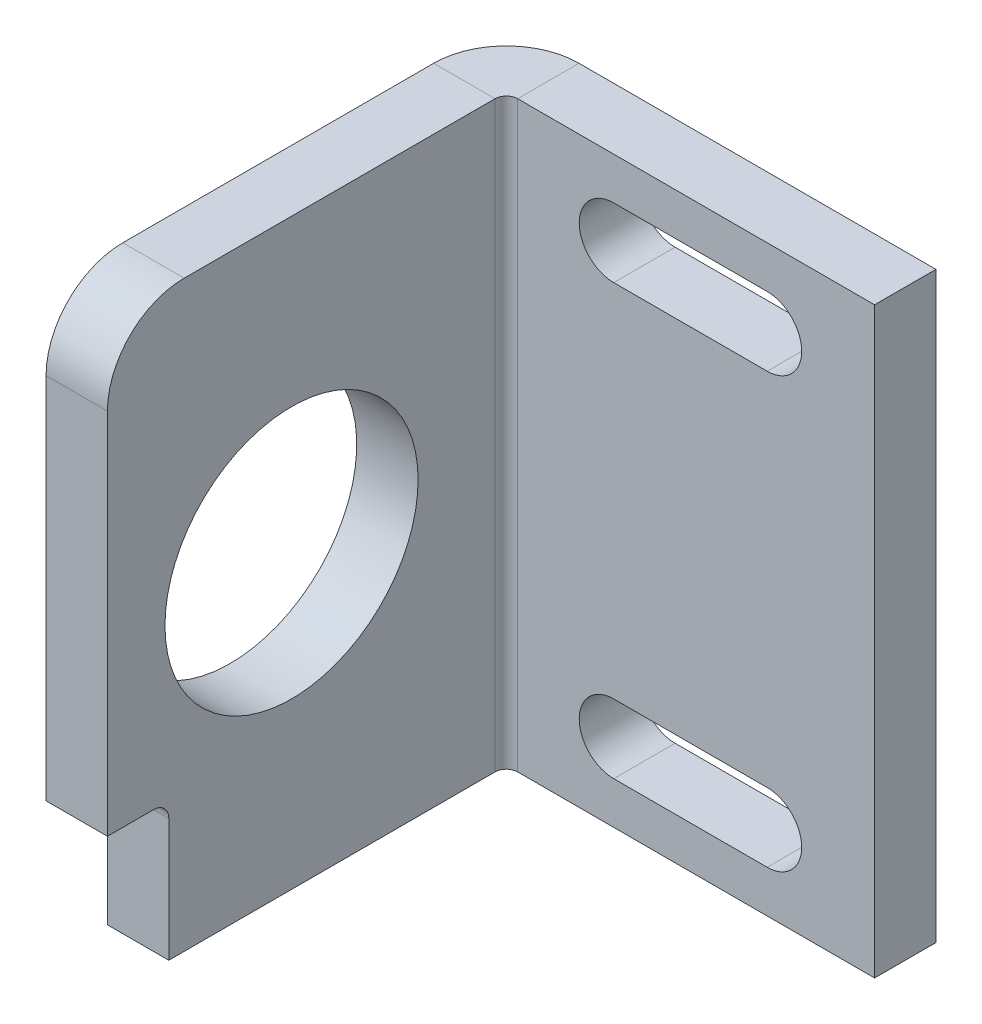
ISO-10303-21;
HEADER;
FILE_DESCRIPTION(('STEP AP214'),'2;1');
FILE_NAME('part.step','',(''),(''),'','','');
FILE_SCHEMA(('AUTOMOTIVE_DESIGN { 1 0 10303 214 1 1 1 1 }'));
ENDSEC;
DATA;
#1=APPLICATION_CONTEXT('core data for automotive mechanical design processes');
#2=APPLICATION_PROTOCOL_DEFINITION('international standard','automotive_design',2000,#1);
#3=PRODUCT_CONTEXT('',#1,'mechanical');
#4=PRODUCT('Part','Part','',(#3));
#5=PRODUCT_RELATED_PRODUCT_CATEGORY('part','',(#4));
#6=PRODUCT_DEFINITION_FORMATION('','',#4);
#7=PRODUCT_DEFINITION_CONTEXT('part definition',#1,'design');
#8=PRODUCT_DEFINITION('design','',#6,#7);
#9=PRODUCT_DEFINITION_SHAPE('','',#8);
#10=(LENGTH_UNIT() NAMED_UNIT(*) SI_UNIT(.MILLI.,.METRE.));
#11=(NAMED_UNIT(*) PLANE_ANGLE_UNIT() SI_UNIT($,.RADIAN.));
#12=(NAMED_UNIT(*) SI_UNIT($,.STERADIAN.) SOLID_ANGLE_UNIT());
#13=UNCERTAINTY_MEASURE_WITH_UNIT(LENGTH_MEASURE(1.E-05),#10,'distance_accuracy_value','');
#14=(GEOMETRIC_REPRESENTATION_CONTEXT(3) GLOBAL_UNCERTAINTY_ASSIGNED_CONTEXT((#13)) GLOBAL_UNIT_ASSIGNED_CONTEXT((#10,
#11,#12)) REPRESENTATION_CONTEXT('',''));
#15=CARTESIAN_POINT('',(0.,0.,0.));
#16=DIRECTION('',(0.,0.,1.));
#17=DIRECTION('',(1.,0.,0.));
#18=AXIS2_PLACEMENT_3D('',#15,#16,#17);
#19=CARTESIAN_POINT('',(-201.807760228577,20.970290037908,-4.));
#20=DIRECTION('',(0.,-1.,0.));
#21=DIRECTION('',(0.,0.,-1.));
#22=AXIS2_PLACEMENT_3D('',#19,#20,#21);
#23=PLANE('',#22);
#24=DIRECTION('',(1.,0.,0.));
#25=VECTOR('',#24,1.);
#26=CARTESIAN_POINT('',(-201.807760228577,20.970290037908,0.));
#27=LINE('',#26,#25);
#28=CARTESIAN_POINT('',(-197.071160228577,20.970290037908,0.));
#29=VERTEX_POINT('',#28);
#30=CARTESIAN_POINT('',(-173.807760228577,20.970290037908,0.));
#31=VERTEX_POINT('',#30);
#32=EDGE_CURVE('E219',#29,#31,#27,.T.);
#33=ORIENTED_EDGE('',*,*,#32,.F.);
#34=DIRECTION('',(0.,0.,-1.));
#35=VECTOR('',#34,1.);
#36=CARTESIAN_POINT('',(-197.071160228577,20.970290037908,0.));
#37=LINE('',#36,#35);
#38=CARTESIAN_POINT('',(-197.071160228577,20.970290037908,-4.));
#39=VERTEX_POINT('',#38);
#40=EDGE_CURVE('E208',#29,#39,#37,.T.);
#41=ORIENTED_EDGE('',*,*,#40,.T.);
#42=DIRECTION('',(1.,0.,0.));
#43=VECTOR('',#42,1.);
#44=CARTESIAN_POINT('',(-201.807760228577,20.970290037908,-4.));
#45=LINE('',#44,#43);
#46=CARTESIAN_POINT('',(-173.807760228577,20.970290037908,-4.));
#47=VERTEX_POINT('',#46);
#48=EDGE_CURVE('E222',#39,#47,#45,.T.);
#49=ORIENTED_EDGE('',*,*,#48,.T.);
#50=DIRECTION('',(0.,0.,1.));
#51=VECTOR('',#50,1.);
#52=CARTESIAN_POINT('',(-173.807760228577,20.970290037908,-4.));
#53=LINE('',#52,#51);
#54=EDGE_CURVE('E231',#47,#31,#53,.T.);
#55=ORIENTED_EDGE('',*,*,#54,.T.);
#56=EDGE_LOOP('',(#33,#41,#49,#55));
#57=FACE_BOUND('',#56,.T.);
#58=ADVANCED_FACE('F16',(#57),#23,.T.);
#59=CARTESIAN_POINT('',(0.,0.,-4.));
#60=DIRECTION('',(0.,0.,1.));
#61=DIRECTION('',(1.,0.,0.));
#62=AXIS2_PLACEMENT_3D('',#59,#60,#61);
#63=PLANE('',#62);
#64=DIRECTION('',(1.,0.,0.));
#65=VECTOR('',#64,1.);
#66=CARTESIAN_POINT('',(-180.807760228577,23.7202900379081,-4.));
#67=LINE('',#66,#65);
#68=CARTESIAN_POINT('',(-190.807760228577,23.7202900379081,-4.));
#69=VERTEX_POINT('',#68);
#70=CARTESIAN_POINT('',(-180.807760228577,23.7202900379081,-4.));
#71=VERTEX_POINT('',#70);
#72=EDGE_CURVE('E282',#69,#71,#67,.T.);
#73=ORIENTED_EDGE('',*,*,#72,.T.);
#74=CARTESIAN_POINT('',(-180.807760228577,25.970290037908,-4.));
#75=DIRECTION('',(0.,0.,1.));
#76=DIRECTION('',(-1.,0.,0.));
#77=AXIS2_PLACEMENT_3D('',#74,#75,#76);
#78=CIRCLE('',#77,2.24999999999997);
#79=CARTESIAN_POINT('',(-180.807760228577,28.220290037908,-4.));
#80=VERTEX_POINT('',#79);
#81=EDGE_CURVE('E272',#71,#80,#78,.T.);
#82=ORIENTED_EDGE('',*,*,#81,.T.);
#83=DIRECTION('',(-1.,0.,0.));
#84=VECTOR('',#83,1.);
#85=CARTESIAN_POINT('',(-180.807760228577,28.220290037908,-4.));
#86=LINE('',#85,#84);
#87=CARTESIAN_POINT('',(-190.807760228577,28.220290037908,-4.));
#88=VERTEX_POINT('',#87);
#89=EDGE_CURVE('E275',#80,#88,#86,.T.);
#90=ORIENTED_EDGE('',*,*,#89,.T.);
#91=CARTESIAN_POINT('',(-190.807760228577,25.970290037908,-4.));
#92=DIRECTION('',(0.,0.,1.));
#93=DIRECTION('',(-1.,0.,0.));
#94=AXIS2_PLACEMENT_3D('',#91,#92,#93);
#95=CIRCLE('',#94,2.24999999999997);
#96=EDGE_CURVE('E279',#88,#69,#95,.T.);
#97=ORIENTED_EDGE('',*,*,#96,.T.);
#98=EDGE_LOOP('',(#73,#82,#90,#97));
#99=FACE_BOUND('',#98,.T.);
#100=DIRECTION('',(1.,0.,0.));
#101=VECTOR('',#100,1.);
#102=CARTESIAN_POINT('',(-180.807760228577,51.7202900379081,-4.));
#103=LINE('',#102,#101);
#104=CARTESIAN_POINT('',(-190.807760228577,51.7202900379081,-4.));
#105=VERTEX_POINT('',#104);
#106=CARTESIAN_POINT('',(-180.807760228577,51.7202900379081,-4.));
#107=VERTEX_POINT('',#106);
#108=EDGE_CURVE('E314',#105,#107,#103,.T.);
#109=ORIENTED_EDGE('',*,*,#108,.T.);
#110=CARTESIAN_POINT('',(-180.807760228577,53.970290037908,-4.));
#111=DIRECTION('',(0.,0.,1.));
#112=DIRECTION('',(1.,0.,0.));
#113=AXIS2_PLACEMENT_3D('',#110,#111,#112);
#114=CIRCLE('',#113,2.24999999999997);
#115=CARTESIAN_POINT('',(-180.807760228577,56.220290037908,-4.));
#116=VERTEX_POINT('',#115);
#117=EDGE_CURVE('E304',#107,#116,#114,.T.);
#118=ORIENTED_EDGE('',*,*,#117,.T.);
#119=DIRECTION('',(-1.,0.,0.));
#120=VECTOR('',#119,1.);
#121=CARTESIAN_POINT('',(-180.807760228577,56.220290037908,-4.));
#122=LINE('',#121,#120);
#123=CARTESIAN_POINT('',(-190.807760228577,56.220290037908,-4.));
#124=VERTEX_POINT('',#123);
#125=EDGE_CURVE('E307',#116,#124,#122,.T.);
#126=ORIENTED_EDGE('',*,*,#125,.T.);
#127=CARTESIAN_POINT('',(-190.807760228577,53.970290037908,-4.));
#128=DIRECTION('',(0.,0.,1.));
#129=DIRECTION('',(1.,0.,0.));
#130=AXIS2_PLACEMENT_3D('',#127,#128,#129);
#131=CIRCLE('',#130,2.24999999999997);
#132=EDGE_CURVE('E311',#124,#105,#131,.T.);
#133=ORIENTED_EDGE('',*,*,#132,.T.);
#134=EDGE_LOOP('',(#109,#118,#126,#133));
#135=FACE_BOUND('',#134,.T.);
#136=DIRECTION('',(0.,-1.,0.));
#137=VECTOR('',#136,1.);
#138=CARTESIAN_POINT('',(-197.071160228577,20.970290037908,-4.));
#139=LINE('',#138,#137);
#140=CARTESIAN_POINT('',(-197.071160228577,58.9702900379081,-4.));
#141=VERTEX_POINT('',#140);
#142=EDGE_CURVE('E202',#39,#141,#139,.F.);
#143=ORIENTED_EDGE('',*,*,#142,.T.);
#144=DIRECTION('',(-1.,0.,0.));
#145=VECTOR('',#144,1.);
#146=CARTESIAN_POINT('',(-201.807760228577,58.970290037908,-4.));
#147=LINE('',#146,#145);
#148=CARTESIAN_POINT('',(-173.807760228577,58.970290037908,-4.));
#149=VERTEX_POINT('',#148);
#150=EDGE_CURVE('E228',#149,#141,#147,.T.);
#151=ORIENTED_EDGE('',*,*,#150,.F.);
#152=DIRECTION('',(0.,1.,0.));
#153=VECTOR('',#152,1.);
#154=CARTESIAN_POINT('',(-173.807760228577,58.970290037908,-4.));
#155=LINE('',#154,#153);
#156=EDGE_CURVE('E224',#47,#149,#155,.T.);
#157=ORIENTED_EDGE('',*,*,#156,.F.);
#158=ORIENTED_EDGE('',*,*,#48,.F.);
#159=EDGE_LOOP('',(#143,#151,#157,#158));
#160=FACE_BOUND('',#159,.T.);
#161=ADVANCED_FACE('F350',(#99,#135,#160),#63,.F.);
#162=CARTESIAN_POINT('',(0.,0.,0.));
#163=DIRECTION('',(0.,0.,1.));
#164=DIRECTION('',(1.,0.,0.));
#165=AXIS2_PLACEMENT_3D('',#162,#163,#164);
#166=PLANE('',#165);
#167=CARTESIAN_POINT('',(-180.807760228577,25.970290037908,0.));
#168=DIRECTION('',(0.,0.,1.));
#169=DIRECTION('',(-1.,0.,0.));
#170=AXIS2_PLACEMENT_3D('',#167,#168,#169);
#171=CIRCLE('',#170,2.24999999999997);
#172=CARTESIAN_POINT('',(-180.807760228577,23.7202900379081,0.));
#173=VERTEX_POINT('',#172);
#174=CARTESIAN_POINT('',(-180.807760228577,28.220290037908,0.));
#175=VERTEX_POINT('',#174);
#176=EDGE_CURVE('E271',#173,#175,#171,.T.);
#177=ORIENTED_EDGE('',*,*,#176,.F.);
#178=DIRECTION('',(1.,0.,0.));
#179=VECTOR('',#178,1.);
#180=CARTESIAN_POINT('',(-180.807760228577,23.7202900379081,0.));
#181=LINE('',#180,#179);
#182=CARTESIAN_POINT('',(-190.807760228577,23.7202900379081,0.));
#183=VERTEX_POINT('',#182);
#184=EDGE_CURVE('E276',#183,#173,#181,.T.);
#185=ORIENTED_EDGE('',*,*,#184,.F.);
#186=CARTESIAN_POINT('',(-190.807760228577,25.970290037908,0.));
#187=DIRECTION('',(0.,0.,1.));
#188=DIRECTION('',(-1.,0.,0.));
#189=AXIS2_PLACEMENT_3D('',#186,#187,#188);
#190=CIRCLE('',#189,2.24999999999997);
#191=CARTESIAN_POINT('',(-190.807760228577,28.220290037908,0.));
#192=VERTEX_POINT('',#191);
#193=EDGE_CURVE('E290',#192,#183,#190,.T.);
#194=ORIENTED_EDGE('',*,*,#193,.F.);
#195=DIRECTION('',(-1.,0.,0.));
#196=VECTOR('',#195,1.);
#197=CARTESIAN_POINT('',(-180.807760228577,28.220290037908,0.));
#198=LINE('',#197,#196);
#199=EDGE_CURVE('E287',#175,#192,#198,.T.);
#200=ORIENTED_EDGE('',*,*,#199,.F.);
#201=EDGE_LOOP('',(#177,#185,#194,#200));
#202=FACE_BOUND('',#201,.T.);
#203=CARTESIAN_POINT('',(-180.807760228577,53.970290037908,0.));
#204=DIRECTION('',(0.,0.,1.));
#205=DIRECTION('',(1.,0.,0.));
#206=AXIS2_PLACEMENT_3D('',#203,#204,#205);
#207=CIRCLE('',#206,2.24999999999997);
#208=CARTESIAN_POINT('',(-180.807760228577,51.7202900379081,0.));
#209=VERTEX_POINT('',#208);
#210=CARTESIAN_POINT('',(-180.807760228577,56.220290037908,0.));
#211=VERTEX_POINT('',#210);
#212=EDGE_CURVE('E297',#209,#211,#207,.T.);
#213=ORIENTED_EDGE('',*,*,#212,.F.);
#214=DIRECTION('',(1.,0.,0.));
#215=VECTOR('',#214,1.);
#216=CARTESIAN_POINT('',(-180.807760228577,51.7202900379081,0.));
#217=LINE('',#216,#215);
#218=CARTESIAN_POINT('',(-190.807760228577,51.7202900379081,0.));
#219=VERTEX_POINT('',#218);
#220=EDGE_CURVE('E308',#219,#209,#217,.T.);
#221=ORIENTED_EDGE('',*,*,#220,.F.);
#222=CARTESIAN_POINT('',(-190.807760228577,53.970290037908,0.));
#223=DIRECTION('',(0.,0.,1.));
#224=DIRECTION('',(1.,0.,0.));
#225=AXIS2_PLACEMENT_3D('',#222,#223,#224);
#226=CIRCLE('',#225,2.24999999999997);
#227=CARTESIAN_POINT('',(-190.807760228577,56.220290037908,0.));
#228=VERTEX_POINT('',#227);
#229=EDGE_CURVE('E322',#228,#219,#226,.T.);
#230=ORIENTED_EDGE('',*,*,#229,.F.);
#231=DIRECTION('',(-1.,0.,0.));
#232=VECTOR('',#231,1.);
#233=CARTESIAN_POINT('',(-180.807760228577,56.220290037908,0.));
#234=LINE('',#233,#232);
#235=EDGE_CURVE('E319',#211,#228,#234,.T.);
#236=ORIENTED_EDGE('',*,*,#235,.F.);
#237=EDGE_LOOP('',(#213,#221,#230,#236));
#238=FACE_BOUND('',#237,.T.);
#239=DIRECTION('',(-1.,0.,0.));
#240=VECTOR('',#239,1.);
#241=CARTESIAN_POINT('',(-201.807760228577,58.970290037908,0.));
#242=LINE('',#241,#240);
#243=CARTESIAN_POINT('',(-173.807760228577,58.970290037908,0.));
#244=VERTEX_POINT('',#243);
#245=CARTESIAN_POINT('',(-197.071160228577,58.970290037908,0.));
#246=VERTEX_POINT('',#245);
#247=EDGE_CURVE('E225',#244,#246,#242,.T.);
#248=ORIENTED_EDGE('',*,*,#247,.T.);
#249=DIRECTION('',(0.,-1.,0.));
#250=VECTOR('',#249,1.);
#251=CARTESIAN_POINT('',(-197.071160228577,20.970290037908,0.));
#252=LINE('',#251,#250);
#253=EDGE_CURVE('E174',#29,#246,#252,.F.);
#254=ORIENTED_EDGE('',*,*,#253,.F.);
#255=ORIENTED_EDGE('',*,*,#32,.T.);
#256=DIRECTION('',(0.,1.,0.));
#257=VECTOR('',#256,1.);
#258=CARTESIAN_POINT('',(-173.807760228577,58.970290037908,0.));
#259=LINE('',#258,#257);
#260=EDGE_CURVE('E233',#31,#244,#259,.T.);
#261=ORIENTED_EDGE('',*,*,#260,.T.);
#262=EDGE_LOOP('',(#248,#254,#255,#261));
#263=FACE_BOUND('',#262,.T.);
#264=ADVANCED_FACE('F343',(#202,#238,#263),#166,.T.);
#265=CARTESIAN_POINT('',(-201.807760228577,58.970290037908,-4.));
#266=DIRECTION('',(0.,1.,0.));
#267=DIRECTION('',(0.,0.,1.));
#268=AXIS2_PLACEMENT_3D('',#265,#266,#267);
#269=PLANE('',#268);
#270=DIRECTION('',(0.,0.,-1.));
#271=VECTOR('',#270,1.);
#272=CARTESIAN_POINT('',(-197.071160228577,58.970290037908,0.));
#273=LINE('',#272,#271);
#274=EDGE_CURVE('E216',#246,#141,#273,.T.);
#275=ORIENTED_EDGE('',*,*,#274,.F.);
#276=ORIENTED_EDGE('',*,*,#247,.F.);
#277=DIRECTION('',(0.,0.,1.));
#278=VECTOR('',#277,1.);
#279=CARTESIAN_POINT('',(-173.807760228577,58.970290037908,-4.));
#280=LINE('',#279,#278);
#281=EDGE_CURVE('E238',#149,#244,#280,.T.);
#282=ORIENTED_EDGE('',*,*,#281,.F.);
#283=ORIENTED_EDGE('',*,*,#150,.T.);
#284=EDGE_LOOP('',(#275,#276,#282,#283));
#285=FACE_BOUND('',#284,.T.);
#286=ADVANCED_FACE('F423',(#285),#269,.T.);
#287=CARTESIAN_POINT('',(-173.807760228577,58.970290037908,-4.));
#288=DIRECTION('',(1.,0.,0.));
#289=DIRECTION('',(0.,0.,-1.));
#290=AXIS2_PLACEMENT_3D('',#287,#288,#289);
#291=PLANE('',#290);
#292=ORIENTED_EDGE('',*,*,#260,.F.);
#293=ORIENTED_EDGE('',*,*,#54,.F.);
#294=ORIENTED_EDGE('',*,*,#156,.T.);
#295=ORIENTED_EDGE('',*,*,#281,.T.);
#296=EDGE_LOOP('',(#292,#293,#294,#295));
#297=FACE_BOUND('',#296,.T.);
#298=ADVANCED_FACE('F378',(#297),#291,.T.);
#299=CARTESIAN_POINT('',(-197.071160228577,58.970290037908,0.7366));
#300=DIRECTION('',(0.,1.,0.));
#301=DIRECTION('',(0.,0.,1.));
#302=AXIS2_PLACEMENT_3D('',#299,#300,#301);
#303=PLANE('',#302);
#304=DIRECTION('',(1.,0.,0.));
#305=VECTOR('',#304,1.);
#306=CARTESIAN_POINT('',(-201.807760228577,58.970290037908,0.736599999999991));
#307=LINE('',#306,#305);
#308=CARTESIAN_POINT('',(-197.807760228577,58.970290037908,0.7366));
#309=VERTEX_POINT('',#308);
#310=CARTESIAN_POINT('',(-201.807760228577,58.970290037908,0.736599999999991));
#311=VERTEX_POINT('',#310);
#312=EDGE_CURVE('E198',#309,#311,#307,.F.);
#313=ORIENTED_EDGE('',*,*,#312,.F.);
#314=CARTESIAN_POINT('',(-197.071160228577,58.970290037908,0.7366));
#315=DIRECTION('',(0.,-1.,0.));
#316=DIRECTION('',(0.,0.,-1.));
#317=AXIS2_PLACEMENT_3D('',#314,#315,#316);
#318=CIRCLE('',#317,0.7366);
#319=EDGE_CURVE('E211',#246,#309,#318,.F.);
#320=ORIENTED_EDGE('',*,*,#319,.F.);
#321=ORIENTED_EDGE('',*,*,#274,.T.);
#322=CARTESIAN_POINT('',(-197.071160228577,58.970290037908,0.7366));
#323=DIRECTION('',(0.,-1.,0.));
#324=DIRECTION('',(0.,0.,-1.));
#325=AXIS2_PLACEMENT_3D('',#322,#323,#324);
#326=CIRCLE('',#325,4.7366);
#327=EDGE_CURVE('E204',#141,#311,#326,.F.);
#328=ORIENTED_EDGE('',*,*,#327,.T.);
#329=EDGE_LOOP('',(#313,#320,#321,#328));
#330=FACE_BOUND('',#329,.T.);
#331=ADVANCED_FACE('F401',(#330),#303,.T.);
#332=CARTESIAN_POINT('',(-197.071160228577,20.970290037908,0.7366));
#333=DIRECTION('',(0.,1.,0.));
#334=DIRECTION('',(0.,0.,1.));
#335=AXIS2_PLACEMENT_3D('',#332,#333,#334);
#336=PLANE('',#335);
#337=CARTESIAN_POINT('',(-197.071160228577,20.970290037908,0.7366));
#338=DIRECTION('',(0.,-1.,0.));
#339=DIRECTION('',(0.,0.,-1.));
#340=AXIS2_PLACEMENT_3D('',#337,#338,#339);
#341=CIRCLE('',#340,0.7366);
#342=CARTESIAN_POINT('',(-197.807760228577,20.970290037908,0.7366));
#343=VERTEX_POINT('',#342);
#344=EDGE_CURVE('E170',#343,#29,#341,.T.);
#345=ORIENTED_EDGE('',*,*,#344,.F.);
#346=DIRECTION('',(1.,0.,0.));
#347=VECTOR('',#346,1.);
#348=CARTESIAN_POINT('',(-197.807760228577,20.970290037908,0.7366));
#349=LINE('',#348,#347);
#350=CARTESIAN_POINT('',(-201.807760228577,20.970290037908,0.736599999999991));
#351=VERTEX_POINT('',#350);
#352=EDGE_CURVE('E193',#343,#351,#349,.F.);
#353=ORIENTED_EDGE('',*,*,#352,.T.);
#354=CARTESIAN_POINT('',(-197.071160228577,20.970290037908,0.7366));
#355=DIRECTION('',(0.,-1.,0.));
#356=DIRECTION('',(0.,0.,-1.));
#357=AXIS2_PLACEMENT_3D('',#354,#355,#356);
#358=CIRCLE('',#357,4.7366);
#359=EDGE_CURVE('E205',#351,#39,#358,.T.);
#360=ORIENTED_EDGE('',*,*,#359,.T.);
#361=ORIENTED_EDGE('',*,*,#40,.F.);
#362=EDGE_LOOP('',(#345,#353,#360,#361));
#363=FACE_BOUND('',#362,.T.);
#364=ADVANCED_FACE('F415',(#363),#336,.F.);
#365=CARTESIAN_POINT('',(-197.071160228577,20.970290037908,0.7366));
#366=DIRECTION('',(0.,-1.,0.));
#367=DIRECTION('',(-1.,0.,0.));
#368=AXIS2_PLACEMENT_3D('',#365,#366,#367);
#369=CYLINDRICAL_SURFACE('',#368,4.7366);
#370=ORIENTED_EDGE('',*,*,#142,.F.);
#371=ORIENTED_EDGE('',*,*,#359,.F.);
#372=DIRECTION('',(0.,-1.,0.));
#373=VECTOR('',#372,1.);
#374=CARTESIAN_POINT('',(-201.807760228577,58.970290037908,0.736599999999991));
#375=LINE('',#374,#373);
#376=EDGE_CURVE('E190',#351,#311,#375,.F.);
#377=ORIENTED_EDGE('',*,*,#376,.T.);
#378=ORIENTED_EDGE('',*,*,#327,.F.);
#379=EDGE_LOOP('',(#370,#371,#377,#378));
#380=FACE_BOUND('',#379,.T.);
#381=ADVANCED_FACE('F419',(#380),#369,.T.);
#382=CARTESIAN_POINT('',(-197.071160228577,20.970290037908,0.7366));
#383=DIRECTION('',(0.,-1.,0.));
#384=DIRECTION('',(-1.,0.,0.));
#385=AXIS2_PLACEMENT_3D('',#382,#383,#384);
#386=CYLINDRICAL_SURFACE('',#385,0.7366);
#387=ORIENTED_EDGE('',*,*,#253,.T.);
#388=ORIENTED_EDGE('',*,*,#319,.T.);
#389=DIRECTION('',(0.,-1.,0.));
#390=VECTOR('',#389,1.);
#391=CARTESIAN_POINT('',(-197.807760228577,58.970290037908,0.7366));
#392=LINE('',#391,#390);
#393=EDGE_CURVE('E196',#309,#343,#392,.T.);
#394=ORIENTED_EDGE('',*,*,#393,.T.);
#395=ORIENTED_EDGE('',*,*,#344,.T.);
#396=EDGE_LOOP('',(#387,#388,#394,#395));
#397=FACE_BOUND('',#396,.T.);
#398=ADVANCED_FACE('F405',(#397),#386,.F.);
#399=CARTESIAN_POINT('',(-201.807760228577,58.970290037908,0.));
#400=DIRECTION('',(0.,-1.,0.));
#401=DIRECTION('',(0.,0.,-1.));
#402=AXIS2_PLACEMENT_3D('',#399,#400,#401);
#403=PLANE('',#402);
#404=DIRECTION('',(0.,0.,-1.));
#405=VECTOR('',#404,1.);
#406=CARTESIAN_POINT('',(-201.807760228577,58.970290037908,-6.60268680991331E-13));
#407=LINE('',#406,#405);
#408=CARTESIAN_POINT('',(-201.807760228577,58.970290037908,21.));
#409=VERTEX_POINT('',#408);
#410=EDGE_CURVE('E176',#409,#311,#407,.T.);
#411=ORIENTED_EDGE('',*,*,#410,.F.);
#412=DIRECTION('',(1.,0.,0.));
#413=VECTOR('',#412,1.);
#414=CARTESIAN_POINT('',(-201.807760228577,58.970290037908,21.));
#415=LINE('',#414,#413);
#416=CARTESIAN_POINT('',(-197.807760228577,58.970290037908,21.));
#417=VERTEX_POINT('',#416);
#418=EDGE_CURVE('E240',#409,#417,#415,.T.);
#419=ORIENTED_EDGE('',*,*,#418,.T.);
#420=DIRECTION('',(0.,0.,1.));
#421=VECTOR('',#420,1.);
#422=CARTESIAN_POINT('',(-197.807760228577,58.970290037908,0.));
#423=LINE('',#422,#421);
#424=EDGE_CURVE('E188',#417,#309,#423,.F.);
#425=ORIENTED_EDGE('',*,*,#424,.T.);
#426=ORIENTED_EDGE('',*,*,#312,.T.);
#427=EDGE_LOOP('',(#411,#419,#425,#426));
#428=FACE_BOUND('',#427,.T.);
#429=ADVANCED_FACE('F396',(#428),#403,.F.);
#430=CARTESIAN_POINT('',(-201.807760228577,20.970290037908,26.));
#431=DIRECTION('',(0.,1.,0.));
#432=DIRECTION('',(0.,0.,1.));
#433=AXIS2_PLACEMENT_3D('',#430,#431,#432);
#434=PLANE('',#433);
#435=DIRECTION('',(0.,0.,-1.));
#436=VECTOR('',#435,1.);
#437=CARTESIAN_POINT('',(-197.807760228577,20.970290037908,26.));
#438=LINE('',#437,#436);
#439=CARTESIAN_POINT('',(-197.807760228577,20.970290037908,22.));
#440=VERTEX_POINT('',#439);
#441=EDGE_CURVE('E185',#343,#440,#438,.F.);
#442=ORIENTED_EDGE('',*,*,#441,.T.);
#443=DIRECTION('',(-1.,0.,0.));
#444=VECTOR('',#443,1.);
#445=CARTESIAN_POINT('',(-173.807760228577,20.970290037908,22.));
#446=LINE('',#445,#444);
#447=CARTESIAN_POINT('',(-201.807760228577,20.970290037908,22.));
#448=VERTEX_POINT('',#447);
#449=EDGE_CURVE('E266',#440,#448,#446,.T.);
#450=ORIENTED_EDGE('',*,*,#449,.T.);
#451=DIRECTION('',(0.,0.,1.));
#452=VECTOR('',#451,1.);
#453=CARTESIAN_POINT('',(-201.807760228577,20.970290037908,-6.60268680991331E-13));
#454=LINE('',#453,#452);
#455=EDGE_CURVE('E171',#351,#448,#454,.T.);
#456=ORIENTED_EDGE('',*,*,#455,.F.);
#457=ORIENTED_EDGE('',*,*,#352,.F.);
#458=EDGE_LOOP('',(#442,#450,#456,#457));
#459=FACE_BOUND('',#458,.T.);
#460=ADVANCED_FACE('F413',(#459),#434,.F.);
#461=CARTESIAN_POINT('',(-201.807760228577,0.,-6.60268680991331E-13));
#462=DIRECTION('',(1.,0.,0.));
#463=DIRECTION('',(0.,0.,-1.));
#464=AXIS2_PLACEMENT_3D('',#461,#462,#463);
#465=PLANE('',#464);
#466=CARTESIAN_POINT('',(-201.807760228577,39.970290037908,14.));
#467=DIRECTION('',(-1.,0.,0.));
#468=DIRECTION('',(0.,0.,1.));
#469=AXIS2_PLACEMENT_3D('',#466,#467,#468);
#470=CIRCLE('',#469,8.25);
#471=CARTESIAN_POINT('',(-201.807760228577,39.970290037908,22.25));
#472=VERTEX_POINT('',#471);
#473=EDGE_CURVE('E179',#472,#472,#470,.T.);
#474=ORIENTED_EDGE('',*,*,#473,.F.);
#475=EDGE_LOOP('',(#474));
#476=FACE_BOUND('',#475,.T.);
#477=ORIENTED_EDGE('',*,*,#455,.T.);
#478=DIRECTION('',(0.,-1.,0.));
#479=VECTOR('',#478,1.);
#480=CARTESIAN_POINT('',(-201.807760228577,20.970290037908,22.));
#481=LINE('',#480,#479);
#482=CARTESIAN_POINT('',(-201.807760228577,28.970290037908,22.));
#483=VERTEX_POINT('',#482);
#484=EDGE_CURVE('E164',#483,#448,#481,.T.);
#485=ORIENTED_EDGE('',*,*,#484,.F.);
#486=CARTESIAN_POINT('',(-201.807760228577,28.970290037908,23.));
#487=DIRECTION('',(1.,0.,0.));
#488=DIRECTION('',(0.,0.,-1.));
#489=AXIS2_PLACEMENT_3D('',#486,#487,#488);
#490=CIRCLE('',#489,1.);
#491=CARTESIAN_POINT('',(-201.807760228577,29.970290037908,23.));
#492=VERTEX_POINT('',#491);
#493=EDGE_CURVE('E24',#483,#492,#490,.T.);
#494=ORIENTED_EDGE('',*,*,#493,.T.);
#495=DIRECTION('',(0.,0.,-1.));
#496=VECTOR('',#495,1.);
#497=CARTESIAN_POINT('',(-201.807760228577,29.970290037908,26.));
#498=LINE('',#497,#496);
#499=CARTESIAN_POINT('',(-201.807760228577,29.970290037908,26.));
#500=VERTEX_POINT('',#499);
#501=EDGE_CURVE('E152',#500,#492,#498,.T.);
#502=ORIENTED_EDGE('',*,*,#501,.F.);
#503=DIRECTION('',(0.,1.,0.));
#504=VECTOR('',#503,1.);
#505=CARTESIAN_POINT('',(-201.807760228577,0.,26.));
#506=LINE('',#505,#504);
#507=CARTESIAN_POINT('',(-201.807760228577,53.970290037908,26.));
#508=VERTEX_POINT('',#507);
#509=EDGE_CURVE('E162',#500,#508,#506,.T.);
#510=ORIENTED_EDGE('',*,*,#509,.T.);
#511=CARTESIAN_POINT('',(-201.807760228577,53.970290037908,21.));
#512=DIRECTION('',(1.,0.,0.));
#513=DIRECTION('',(0.,0.,-1.));
#514=AXIS2_PLACEMENT_3D('',#511,#512,#513);
#515=CIRCLE('',#514,5.);
#516=EDGE_CURVE('E158',#508,#409,#515,.F.);
#517=ORIENTED_EDGE('',*,*,#516,.T.);
#518=ORIENTED_EDGE('',*,*,#410,.T.);
#519=ORIENTED_EDGE('',*,*,#376,.F.);
#520=EDGE_LOOP('',(#477,#485,#494,#502,#510,#517,#518,#519));
#521=FACE_BOUND('',#520,.T.);
#522=ADVANCED_FACE('F161',(#476,#521),#465,.F.);
#523=CARTESIAN_POINT('',(-197.807760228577,0.,-6.46302755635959E-13));
#524=DIRECTION('',(1.,0.,0.));
#525=DIRECTION('',(0.,0.,-1.));
#526=AXIS2_PLACEMENT_3D('',#523,#524,#525);
#527=PLANE('',#526);
#528=DIRECTION('',(0.,1.,0.));
#529=VECTOR('',#528,1.);
#530=CARTESIAN_POINT('',(-197.807760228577,0.,22.));
#531=LINE('',#530,#529);
#532=CARTESIAN_POINT('',(-197.807760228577,28.970290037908,22.));
#533=VERTEX_POINT('',#532);
#534=EDGE_CURVE('E157',#440,#533,#531,.T.);
#535=ORIENTED_EDGE('',*,*,#534,.F.);
#536=ORIENTED_EDGE('',*,*,#441,.F.);
#537=ORIENTED_EDGE('',*,*,#393,.F.);
#538=ORIENTED_EDGE('',*,*,#424,.F.);
#539=CARTESIAN_POINT('',(-197.807760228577,53.970290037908,21.));
#540=DIRECTION('',(1.,0.,0.));
#541=DIRECTION('',(0.,0.,-1.));
#542=AXIS2_PLACEMENT_3D('',#539,#540,#541);
#543=CIRCLE('',#542,5.);
#544=CARTESIAN_POINT('',(-197.807760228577,53.970290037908,26.));
#545=VERTEX_POINT('',#544);
#546=EDGE_CURVE('E247',#417,#545,#543,.T.);
#547=ORIENTED_EDGE('',*,*,#546,.T.);
#548=DIRECTION('',(0.,-1.,0.));
#549=VECTOR('',#548,1.);
#550=CARTESIAN_POINT('',(-197.807760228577,58.970290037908,26.));
#551=LINE('',#550,#549);
#552=CARTESIAN_POINT('',(-197.807760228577,29.970290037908,26.));
#553=VERTEX_POINT('',#552);
#554=EDGE_CURVE('E183',#553,#545,#551,.F.);
#555=ORIENTED_EDGE('',*,*,#554,.F.);
#556=DIRECTION('',(0.,0.,1.));
#557=VECTOR('',#556,1.);
#558=CARTESIAN_POINT('',(-197.807760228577,29.970290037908,-6.46302755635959E-13));
#559=LINE('',#558,#557);
#560=CARTESIAN_POINT('',(-197.807760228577,29.970290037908,23.));
#561=VERTEX_POINT('',#560);
#562=EDGE_CURVE('E153',#561,#553,#559,.T.);
#563=ORIENTED_EDGE('',*,*,#562,.F.);
#564=CARTESIAN_POINT('',(-197.807760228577,28.970290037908,23.));
#565=DIRECTION('',(1.,0.,0.));
#566=DIRECTION('',(0.,0.,-1.));
#567=AXIS2_PLACEMENT_3D('',#564,#565,#566);
#568=CIRCLE('',#567,1.);
#569=EDGE_CURVE('E11',#561,#533,#568,.F.);
#570=ORIENTED_EDGE('',*,*,#569,.T.);
#571=EDGE_LOOP('',(#535,#536,#537,#538,#547,#555,#563,#570));
#572=FACE_BOUND('',#571,.T.);
#573=CARTESIAN_POINT('',(-197.807760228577,39.970290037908,14.));
#574=DIRECTION('',(1.,0.,0.));
#575=DIRECTION('',(0.,0.,-1.));
#576=AXIS2_PLACEMENT_3D('',#573,#574,#575);
#577=CIRCLE('',#576,8.25);
#578=CARTESIAN_POINT('',(-197.807760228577,39.970290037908,5.75));
#579=VERTEX_POINT('',#578);
#580=EDGE_CURVE('E201',#579,#579,#577,.T.);
#581=ORIENTED_EDGE('',*,*,#580,.F.);
#582=EDGE_LOOP('',(#581));
#583=FACE_BOUND('',#582,.T.);
#584=ADVANCED_FACE('F409',(#572,#583),#527,.T.);
#585=CARTESIAN_POINT('',(-201.807760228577,58.970290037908,26.));
#586=DIRECTION('',(0.,0.,-1.));
#587=DIRECTION('',(-1.,0.,0.));
#588=AXIS2_PLACEMENT_3D('',#585,#586,#587);
#589=PLANE('',#588);
#590=ORIENTED_EDGE('',*,*,#509,.F.);
#591=DIRECTION('',(1.,0.,0.));
#592=VECTOR('',#591,1.);
#593=CARTESIAN_POINT('',(-201.807760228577,29.970290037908,26.));
#594=LINE('',#593,#592);
#595=EDGE_CURVE('E150',#500,#553,#594,.T.);
#596=ORIENTED_EDGE('',*,*,#595,.T.);
#597=ORIENTED_EDGE('',*,*,#554,.T.);
#598=DIRECTION('',(1.,0.,0.));
#599=VECTOR('',#598,1.);
#600=CARTESIAN_POINT('',(-201.807760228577,53.970290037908,26.));
#601=LINE('',#600,#599);
#602=EDGE_CURVE('E168',#545,#508,#601,.F.);
#603=ORIENTED_EDGE('',*,*,#602,.T.);
#604=EDGE_LOOP('',(#590,#596,#597,#603));
#605=FACE_BOUND('',#604,.T.);
#606=ADVANCED_FACE('F166',(#605),#589,.F.);
#607=CARTESIAN_POINT('',(-173.807760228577,39.970290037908,14.));
#608=DIRECTION('',(-1.,0.,0.));
#609=DIRECTION('',(0.,0.,1.));
#610=AXIS2_PLACEMENT_3D('',#607,#608,#609);
#611=CYLINDRICAL_SURFACE('',#610,8.25);
#612=ORIENTED_EDGE('',*,*,#580,.T.);
#613=EDGE_LOOP('',(#612));
#614=FACE_BOUND('',#613,.T.);
#615=ORIENTED_EDGE('',*,*,#473,.T.);
#616=EDGE_LOOP('',(#615));
#617=FACE_BOUND('',#616,.T.);
#618=ADVANCED_FACE('F364',(#614,#617),#611,.F.);
#619=CARTESIAN_POINT('',(-180.807760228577,53.970290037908,-4.));
#620=DIRECTION('',(0.,0.,1.));
#621=DIRECTION('',(1.,0.,0.));
#622=AXIS2_PLACEMENT_3D('',#619,#620,#621);
#623=CYLINDRICAL_SURFACE('',#622,2.24999999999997);
#624=ORIENTED_EDGE('',*,*,#212,.T.);
#625=DIRECTION('',(0.,0.,1.));
#626=VECTOR('',#625,1.);
#627=CARTESIAN_POINT('',(-180.807760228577,56.220290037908,-4.));
#628=LINE('',#627,#626);
#629=EDGE_CURVE('E317',#116,#211,#628,.T.);
#630=ORIENTED_EDGE('',*,*,#629,.F.);
#631=ORIENTED_EDGE('',*,*,#117,.F.);
#632=DIRECTION('',(0.,0.,1.));
#633=VECTOR('',#632,1.);
#634=CARTESIAN_POINT('',(-180.807760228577,51.7202900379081,-4.));
#635=LINE('',#634,#633);
#636=EDGE_CURVE('E327',#107,#209,#635,.T.);
#637=ORIENTED_EDGE('',*,*,#636,.T.);
#638=EDGE_LOOP('',(#624,#630,#631,#637));
#639=FACE_BOUND('',#638,.T.);
#640=ADVANCED_FACE('F352',(#639),#623,.F.);
#641=CARTESIAN_POINT('',(-180.807760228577,51.7202900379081,-4.));
#642=DIRECTION('',(0.,-1.,0.));
#643=DIRECTION('',(0.,0.,-1.));
#644=AXIS2_PLACEMENT_3D('',#641,#642,#643);
#645=PLANE('',#644);
#646=ORIENTED_EDGE('',*,*,#220,.T.);
#647=ORIENTED_EDGE('',*,*,#636,.F.);
#648=ORIENTED_EDGE('',*,*,#108,.F.);
#649=DIRECTION('',(0.,0.,1.));
#650=VECTOR('',#649,1.);
#651=CARTESIAN_POINT('',(-190.807760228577,51.7202900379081,-4.));
#652=LINE('',#651,#650);
#653=EDGE_CURVE('E329',#105,#219,#652,.T.);
#654=ORIENTED_EDGE('',*,*,#653,.T.);
#655=EDGE_LOOP('',(#646,#647,#648,#654));
#656=FACE_BOUND('',#655,.T.);
#657=ADVANCED_FACE('F354',(#656),#645,.F.);
#658=CARTESIAN_POINT('',(-190.807760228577,53.970290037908,-4.));
#659=DIRECTION('',(0.,0.,1.));
#660=DIRECTION('',(1.,0.,0.));
#661=AXIS2_PLACEMENT_3D('',#658,#659,#660);
#662=CYLINDRICAL_SURFACE('',#661,2.24999999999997);
#663=ORIENTED_EDGE('',*,*,#229,.T.);
#664=ORIENTED_EDGE('',*,*,#653,.F.);
#665=ORIENTED_EDGE('',*,*,#132,.F.);
#666=DIRECTION('',(0.,0.,1.));
#667=VECTOR('',#666,1.);
#668=CARTESIAN_POINT('',(-190.807760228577,56.220290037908,-4.));
#669=LINE('',#668,#667);
#670=EDGE_CURVE('E331',#124,#228,#669,.T.);
#671=ORIENTED_EDGE('',*,*,#670,.T.);
#672=EDGE_LOOP('',(#663,#664,#665,#671));
#673=FACE_BOUND('',#672,.T.);
#674=ADVANCED_FACE('F347',(#673),#662,.F.);
#675=CARTESIAN_POINT('',(-180.807760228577,56.220290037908,-4.));
#676=DIRECTION('',(0.,1.,0.));
#677=DIRECTION('',(0.,0.,1.));
#678=AXIS2_PLACEMENT_3D('',#675,#676,#677);
#679=PLANE('',#678);
#680=ORIENTED_EDGE('',*,*,#235,.T.);
#681=ORIENTED_EDGE('',*,*,#670,.F.);
#682=ORIENTED_EDGE('',*,*,#125,.F.);
#683=ORIENTED_EDGE('',*,*,#629,.T.);
#684=EDGE_LOOP('',(#680,#681,#682,#683));
#685=FACE_BOUND('',#684,.T.);
#686=ADVANCED_FACE('F336',(#685),#679,.F.);
#687=CARTESIAN_POINT('',(-180.807760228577,25.970290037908,-4.));
#688=DIRECTION('',(0.,0.,1.));
#689=DIRECTION('',(1.,0.,0.));
#690=AXIS2_PLACEMENT_3D('',#687,#688,#689);
#691=CYLINDRICAL_SURFACE('',#690,2.24999999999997);
#692=ORIENTED_EDGE('',*,*,#176,.T.);
#693=DIRECTION('',(0.,0.,1.));
#694=VECTOR('',#693,1.);
#695=CARTESIAN_POINT('',(-180.807760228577,28.220290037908,-4.));
#696=LINE('',#695,#694);
#697=EDGE_CURVE('E285',#80,#175,#696,.T.);
#698=ORIENTED_EDGE('',*,*,#697,.F.);
#699=ORIENTED_EDGE('',*,*,#81,.F.);
#700=DIRECTION('',(0.,0.,1.));
#701=VECTOR('',#700,1.);
#702=CARTESIAN_POINT('',(-180.807760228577,23.7202900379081,-4.));
#703=LINE('',#702,#701);
#704=EDGE_CURVE('E295',#71,#173,#703,.T.);
#705=ORIENTED_EDGE('',*,*,#704,.T.);
#706=EDGE_LOOP('',(#692,#698,#699,#705));
#707=FACE_BOUND('',#706,.T.);
#708=ADVANCED_FACE('F460',(#707),#691,.F.);
#709=CARTESIAN_POINT('',(-180.807760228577,23.7202900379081,-4.));
#710=DIRECTION('',(0.,-1.,0.));
#711=DIRECTION('',(0.,0.,-1.));
#712=AXIS2_PLACEMENT_3D('',#709,#710,#711);
#713=PLANE('',#712);
#714=ORIENTED_EDGE('',*,*,#184,.T.);
#715=ORIENTED_EDGE('',*,*,#704,.F.);
#716=ORIENTED_EDGE('',*,*,#72,.F.);
#717=DIRECTION('',(0.,0.,1.));
#718=VECTOR('',#717,1.);
#719=CARTESIAN_POINT('',(-190.807760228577,23.7202900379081,-4.));
#720=LINE('',#719,#718);
#721=EDGE_CURVE('E298',#69,#183,#720,.T.);
#722=ORIENTED_EDGE('',*,*,#721,.T.);
#723=EDGE_LOOP('',(#714,#715,#716,#722));
#724=FACE_BOUND('',#723,.T.);
#725=ADVANCED_FACE('F465',(#724),#713,.F.);
#726=CARTESIAN_POINT('',(-190.807760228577,25.970290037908,-4.));
#727=DIRECTION('',(0.,0.,1.));
#728=DIRECTION('',(1.,0.,0.));
#729=AXIS2_PLACEMENT_3D('',#726,#727,#728);
#730=CYLINDRICAL_SURFACE('',#729,2.24999999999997);
#731=ORIENTED_EDGE('',*,*,#193,.T.);
#732=ORIENTED_EDGE('',*,*,#721,.F.);
#733=ORIENTED_EDGE('',*,*,#96,.F.);
#734=DIRECTION('',(0.,0.,1.));
#735=VECTOR('',#734,1.);
#736=CARTESIAN_POINT('',(-190.807760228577,28.220290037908,-4.));
#737=LINE('',#736,#735);
#738=EDGE_CURVE('E300',#88,#192,#737,.T.);
#739=ORIENTED_EDGE('',*,*,#738,.T.);
#740=EDGE_LOOP('',(#731,#732,#733,#739));
#741=FACE_BOUND('',#740,.T.);
#742=ADVANCED_FACE('F390',(#741),#730,.F.);
#743=CARTESIAN_POINT('',(-180.807760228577,28.220290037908,-4.));
#744=DIRECTION('',(0.,1.,0.));
#745=DIRECTION('',(0.,0.,1.));
#746=AXIS2_PLACEMENT_3D('',#743,#744,#745);
#747=PLANE('',#746);
#748=ORIENTED_EDGE('',*,*,#199,.T.);
#749=ORIENTED_EDGE('',*,*,#738,.F.);
#750=ORIENTED_EDGE('',*,*,#89,.F.);
#751=ORIENTED_EDGE('',*,*,#697,.T.);
#752=EDGE_LOOP('',(#748,#749,#750,#751));
#753=FACE_BOUND('',#752,.T.);
#754=ADVANCED_FACE('F382',(#753),#747,.F.);
#755=CARTESIAN_POINT('',(-201.807760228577,53.970290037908,21.));
#756=DIRECTION('',(1.,0.,0.));
#757=DIRECTION('',(0.,0.,-1.));
#758=AXIS2_PLACEMENT_3D('',#755,#756,#757);
#759=CYLINDRICAL_SURFACE('',#758,5.);
#760=ORIENTED_EDGE('',*,*,#516,.F.);
#761=ORIENTED_EDGE('',*,*,#602,.F.);
#762=ORIENTED_EDGE('',*,*,#546,.F.);
#763=ORIENTED_EDGE('',*,*,#418,.F.);
#764=EDGE_LOOP('',(#760,#761,#762,#763));
#765=FACE_BOUND('',#764,.T.);
#766=ADVANCED_FACE('F380',(#765),#759,.T.);
#767=CARTESIAN_POINT('',(-173.807760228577,20.970290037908,22.));
#768=DIRECTION('',(0.,0.,-1.));
#769=DIRECTION('',(-1.,0.,0.));
#770=AXIS2_PLACEMENT_3D('',#767,#768,#769);
#771=PLANE('',#770);
#772=ORIENTED_EDGE('',*,*,#534,.T.);
#773=DIRECTION('',(-1.,0.,0.));
#774=VECTOR('',#773,1.);
#775=CARTESIAN_POINT('',(-201.807760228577,28.970290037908,22.));
#776=LINE('',#775,#774);
#777=EDGE_CURVE('E254',#533,#483,#776,.T.);
#778=ORIENTED_EDGE('',*,*,#777,.T.);
#779=ORIENTED_EDGE('',*,*,#484,.T.);
#780=ORIENTED_EDGE('',*,*,#449,.F.);
#781=EDGE_LOOP('',(#772,#778,#779,#780));
#782=FACE_BOUND('',#781,.T.);
#783=ADVANCED_FACE('F259',(#782),#771,.F.);
#784=CARTESIAN_POINT('',(-173.807760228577,29.970290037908,26.));
#785=DIRECTION('',(0.,1.,0.));
#786=DIRECTION('',(0.,0.,1.));
#787=AXIS2_PLACEMENT_3D('',#784,#785,#786);
#788=PLANE('',#787);
#789=ORIENTED_EDGE('',*,*,#501,.T.);
#790=DIRECTION('',(-1.,0.,0.));
#791=VECTOR('',#790,1.);
#792=CARTESIAN_POINT('',(-197.807760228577,29.970290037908,23.));
#793=LINE('',#792,#791);
#794=EDGE_CURVE('E37',#492,#561,#793,.F.);
#795=ORIENTED_EDGE('',*,*,#794,.T.);
#796=ORIENTED_EDGE('',*,*,#562,.T.);
#797=ORIENTED_EDGE('',*,*,#595,.F.);
#798=EDGE_LOOP('',(#789,#795,#796,#797));
#799=FACE_BOUND('',#798,.T.);
#800=ADVANCED_FACE('F151',(#799),#788,.F.);
#801=CARTESIAN_POINT('',(-173.807760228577,28.970290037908,23.));
#802=DIRECTION('',(1.,0.,0.));
#803=DIRECTION('',(0.,0.,-1.));
#804=AXIS2_PLACEMENT_3D('',#801,#802,#803);
#805=CYLINDRICAL_SURFACE('',#804,1.);
#806=ORIENTED_EDGE('',*,*,#569,.F.);
#807=ORIENTED_EDGE('',*,*,#794,.F.);
#808=ORIENTED_EDGE('',*,*,#493,.F.);
#809=ORIENTED_EDGE('',*,*,#777,.F.);
#810=EDGE_LOOP('',(#806,#807,#808,#809));
#811=FACE_BOUND('',#810,.T.);
#812=ADVANCED_FACE('F18',(#811),#805,.F.);
#813=CLOSED_SHELL('',(#58,#161,#264,#286,#298,#331,#364,#381,#398,#429,#460,#522,#584,#606,#618,
#640,#657,#674,#686,#708,#725,#742,#754,#766,#783,#800,#812));
#814=MANIFOLD_SOLID_BREP('B1',#813);
#815=ADVANCED_BREP_SHAPE_REPRESENTATION('',(#18,#814),#14);
#816=SHAPE_DEFINITION_REPRESENTATION(#9,#815);
ENDSEC;
END-ISO-10303-21;
